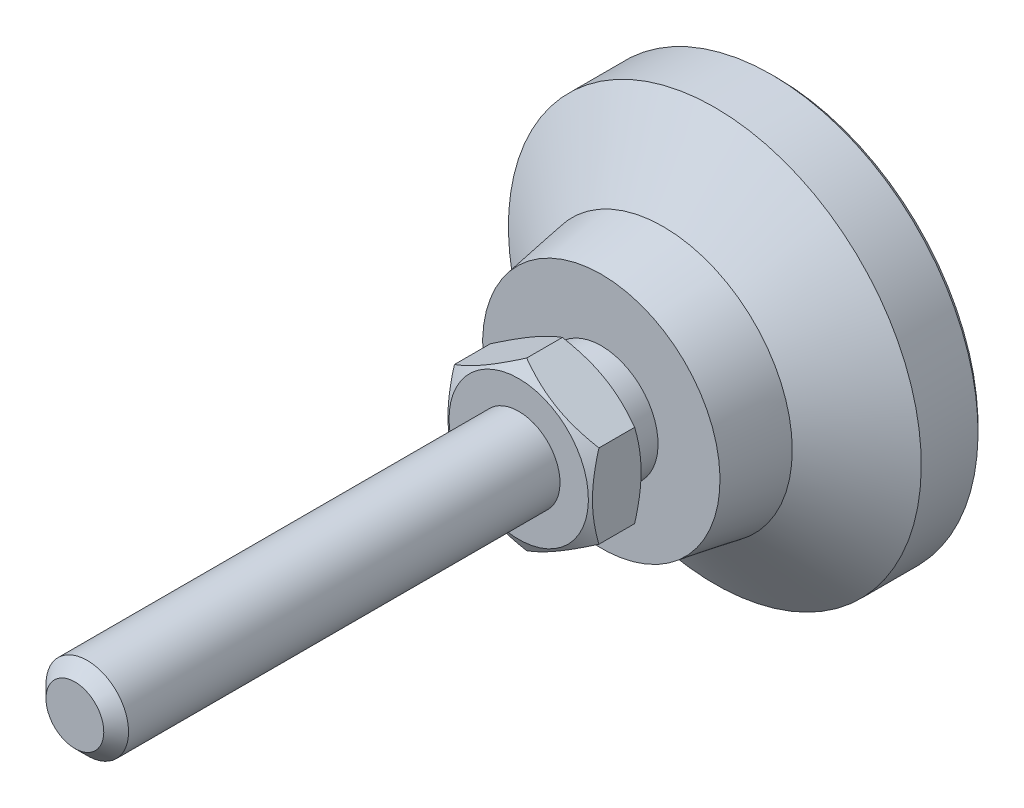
ISO-10303-21;
HEADER;
FILE_DESCRIPTION(('STEP AP214'),'2;1');
FILE_NAME('part.step','',(''),(''),'','','');
FILE_SCHEMA(('AUTOMOTIVE_DESIGN { 1 0 10303 214 1 1 1 1 }'));
ENDSEC;
DATA;
#1=APPLICATION_CONTEXT('core data for automotive mechanical design processes');
#2=APPLICATION_PROTOCOL_DEFINITION('international standard','automotive_design',2000,#1);
#3=PRODUCT_CONTEXT('',#1,'mechanical');
#4=PRODUCT('Part','Part','',(#3));
#5=PRODUCT_RELATED_PRODUCT_CATEGORY('part','',(#4));
#6=PRODUCT_DEFINITION_FORMATION('','',#4);
#7=PRODUCT_DEFINITION_CONTEXT('part definition',#1,'design');
#8=PRODUCT_DEFINITION('design','',#6,#7);
#9=PRODUCT_DEFINITION_SHAPE('','',#8);
#10=(LENGTH_UNIT() NAMED_UNIT(*) SI_UNIT(.MILLI.,.METRE.));
#11=(NAMED_UNIT(*) PLANE_ANGLE_UNIT() SI_UNIT($,.RADIAN.));
#12=(NAMED_UNIT(*) SI_UNIT($,.STERADIAN.) SOLID_ANGLE_UNIT());
#13=UNCERTAINTY_MEASURE_WITH_UNIT(LENGTH_MEASURE(1.E-05),#10,'distance_accuracy_value','');
#14=(GEOMETRIC_REPRESENTATION_CONTEXT(3) GLOBAL_UNCERTAINTY_ASSIGNED_CONTEXT((#13)) GLOBAL_UNIT_ASSIGNED_CONTEXT((#10,
#11,#12)) REPRESENTATION_CONTEXT('',''));
#15=CARTESIAN_POINT('',(0.,0.,0.));
#16=DIRECTION('',(0.,0.,1.));
#17=DIRECTION('',(1.,0.,0.));
#18=AXIS2_PLACEMENT_3D('',#15,#16,#17);
#19=CARTESIAN_POINT('',(-5.49999999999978,0.,20.));
#20=DIRECTION('',(0.,0.,1.));
#21=DIRECTION('',(0.,-1.,0.));
#22=AXIS2_PLACEMENT_3D('',#19,#20,#21);
#23=PLANE('',#22);
#24=CARTESIAN_POINT('',(0.,0.,20.));
#25=DIRECTION('',(0.,0.,-1.));
#26=DIRECTION('',(0.,1.,0.));
#27=AXIS2_PLACEMENT_3D('',#24,#25,#26);
#28=CIRCLE('',#27,5.49999999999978);
#29=CARTESIAN_POINT('',(0.,5.49999999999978,20.));
#30=VERTEX_POINT('',#29);
#31=EDGE_CURVE('E103',#30,#30,#28,.T.);
#32=ORIENTED_EDGE('',*,*,#31,.F.);
#33=EDGE_LOOP('',(#32));
#34=FACE_BOUND('',#33,.T.);
#35=CARTESIAN_POINT('',(0.,0.,20.));
#36=DIRECTION('',(0.,0.,-1.));
#37=DIRECTION('',(0.,1.,0.));
#38=AXIS2_PLACEMENT_3D('',#35,#36,#37);
#39=CIRCLE('',#38,6.75);
#40=CARTESIAN_POINT('',(0.,6.75,20.));
#41=VERTEX_POINT('',#40);
#42=EDGE_CURVE('E73',#41,#41,#39,.T.);
#43=ORIENTED_EDGE('',*,*,#42,.T.);
#44=EDGE_LOOP('',(#43));
#45=FACE_BOUND('',#44,.T.);
#46=ADVANCED_FACE('F14',(#34,#45),#23,.F.);
#47=CARTESIAN_POINT('',(0.,0.,-1.00000000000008));
#48=DIRECTION('',(0.,0.,-1.));
#49=DIRECTION('',(0.,1.,0.));
#50=AXIS2_PLACEMENT_3D('',#47,#48,#49);
#51=CYLINDRICAL_SURFACE('',#50,20.);
#52=CARTESIAN_POINT('',(0.,0.,0.500000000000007));
#53=DIRECTION('',(0.,0.,-1.));
#54=DIRECTION('',(0.,1.,0.));
#55=AXIS2_PLACEMENT_3D('',#52,#53,#54);
#56=CIRCLE('',#55,20.);
#57=CARTESIAN_POINT('',(0.,20.,0.500000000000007));
#58=VERTEX_POINT('',#57);
#59=EDGE_CURVE('E9',#58,#58,#56,.F.);
#60=ORIENTED_EDGE('',*,*,#59,.T.);
#61=EDGE_LOOP('',(#60));
#62=FACE_BOUND('',#61,.T.);
#63=CARTESIAN_POINT('',(0.,0.,6.));
#64=DIRECTION('',(0.,0.,-1.));
#65=DIRECTION('',(0.,1.,0.));
#66=AXIS2_PLACEMENT_3D('',#63,#64,#65);
#67=CIRCLE('',#66,20.);
#68=CARTESIAN_POINT('',(0.,20.,6.));
#69=VERTEX_POINT('',#68);
#70=EDGE_CURVE('E115',#69,#69,#67,.T.);
#71=ORIENTED_EDGE('',*,*,#70,.T.);
#72=EDGE_LOOP('',(#71));
#73=FACE_BOUND('',#72,.T.);
#74=ADVANCED_FACE('F136',(#62,#73),#51,.T.);
#75=CARTESIAN_POINT('',(0.,0.,11.));
#76=DIRECTION('',(0.,0.,-1.));
#77=DIRECTION('',(0.,1.,0.));
#78=AXIS2_PLACEMENT_3D('',#75,#76,#77);
#79=CONICAL_SURFACE('',#78,12.5,0.98279372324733);
#80=ORIENTED_EDGE('',*,*,#70,.F.);
#81=EDGE_LOOP('',(#80));
#82=FACE_BOUND('',#81,.T.);
#83=CARTESIAN_POINT('',(0.,0.,11.));
#84=DIRECTION('',(0.,0.,-1.));
#85=DIRECTION('',(0.,1.,0.));
#86=AXIS2_PLACEMENT_3D('',#83,#84,#85);
#87=CIRCLE('',#86,12.5);
#88=CARTESIAN_POINT('',(0.,12.5,11.));
#89=VERTEX_POINT('',#88);
#90=EDGE_CURVE('E112',#89,#89,#87,.T.);
#91=ORIENTED_EDGE('',*,*,#90,.T.);
#92=EDGE_LOOP('',(#91));
#93=FACE_BOUND('',#92,.T.);
#94=ADVANCED_FACE('F143',(#82,#93),#79,.T.);
#95=CARTESIAN_POINT('',(0.,0.,17.));
#96=DIRECTION('',(0.,0.,-1.));
#97=DIRECTION('',(0.,1.,0.));
#98=AXIS2_PLACEMENT_3D('',#95,#96,#97);
#99=CONICAL_SURFACE('',#98,11.5,0.165148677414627);
#100=ORIENTED_EDGE('',*,*,#90,.F.);
#101=EDGE_LOOP('',(#100));
#102=FACE_BOUND('',#101,.T.);
#103=CARTESIAN_POINT('',(0.,0.,17.));
#104=DIRECTION('',(0.,0.,-1.));
#105=DIRECTION('',(0.,1.,0.));
#106=AXIS2_PLACEMENT_3D('',#103,#104,#105);
#107=CIRCLE('',#106,11.5);
#108=CARTESIAN_POINT('',(0.,11.5,17.));
#109=VERTEX_POINT('',#108);
#110=EDGE_CURVE('E109',#109,#109,#107,.T.);
#111=ORIENTED_EDGE('',*,*,#110,.T.);
#112=EDGE_LOOP('',(#111));
#113=FACE_BOUND('',#112,.T.);
#114=ADVANCED_FACE('F157',(#102,#113),#99,.T.);
#115=CARTESIAN_POINT('',(-11.5,0.,17.));
#116=DIRECTION('',(0.,0.,-1.));
#117=DIRECTION('',(0.,1.,0.));
#118=AXIS2_PLACEMENT_3D('',#115,#116,#117);
#119=PLANE('',#118);
#120=ORIENTED_EDGE('',*,*,#110,.F.);
#121=EDGE_LOOP('',(#120));
#122=FACE_BOUND('',#121,.T.);
#123=CARTESIAN_POINT('',(0.,0.,17.));
#124=DIRECTION('',(0.,0.,-1.));
#125=DIRECTION('',(0.,1.,0.));
#126=AXIS2_PLACEMENT_3D('',#123,#124,#125);
#127=CIRCLE('',#126,5.49999999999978);
#128=CARTESIAN_POINT('',(0.,5.49999999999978,17.));
#129=VERTEX_POINT('',#128);
#130=EDGE_CURVE('E106',#129,#129,#127,.T.);
#131=ORIENTED_EDGE('',*,*,#130,.T.);
#132=EDGE_LOOP('',(#131));
#133=FACE_BOUND('',#132,.T.);
#134=ADVANCED_FACE('F153',(#122,#133),#119,.F.);
#135=CARTESIAN_POINT('',(0.,0.,-1.00000000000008));
#136=DIRECTION('',(0.,0.,-1.));
#137=DIRECTION('',(0.,1.,0.));
#138=AXIS2_PLACEMENT_3D('',#135,#136,#137);
#139=CYLINDRICAL_SURFACE('',#138,5.49999999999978);
#140=ORIENTED_EDGE('',*,*,#130,.F.);
#141=EDGE_LOOP('',(#140));
#142=FACE_BOUND('',#141,.T.);
#143=ORIENTED_EDGE('',*,*,#31,.T.);
#144=EDGE_LOOP('',(#143));
#145=FACE_BOUND('',#144,.T.);
#146=ADVANCED_FACE('F132',(#142,#145),#139,.T.);
#147=CARTESIAN_POINT('',(0.,0.,0.));
#148=DIRECTION('',(0.,0.,-1.));
#149=DIRECTION('',(0.,1.,0.));
#150=AXIS2_PLACEMENT_3D('',#147,#148,#149);
#151=PLANE('',#150);
#152=CARTESIAN_POINT('',(0.,0.,0.));
#153=DIRECTION('',(0.,0.,-1.));
#154=DIRECTION('',(0.,1.,0.));
#155=AXIS2_PLACEMENT_3D('',#152,#153,#154);
#156=CIRCLE('',#155,19.5);
#157=CARTESIAN_POINT('',(0.,19.5,0.));
#158=VERTEX_POINT('',#157);
#159=EDGE_CURVE('E22',#158,#158,#156,.T.);
#160=ORIENTED_EDGE('',*,*,#159,.T.);
#161=EDGE_LOOP('',(#160));
#162=FACE_BOUND('',#161,.T.);
#163=ADVANCED_FACE('F120',(#162),#151,.T.);
#164=CARTESIAN_POINT('',(0.,0.,0.));
#165=DIRECTION('',(0.,0.,1.));
#166=DIRECTION('',(0.,-1.,0.));
#167=AXIS2_PLACEMENT_3D('',#164,#165,#166);
#168=CONICAL_SURFACE('',#167,19.5,0.785398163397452);
#169=ORIENTED_EDGE('',*,*,#59,.F.);
#170=EDGE_LOOP('',(#169));
#171=FACE_BOUND('',#170,.T.);
#172=ORIENTED_EDGE('',*,*,#159,.F.);
#173=EDGE_LOOP('',(#172));
#174=FACE_BOUND('',#173,.T.);
#175=ADVANCED_FACE('F16',(#171,#174),#168,.T.);
#176=CARTESIAN_POINT('',(0.,0.,20.));
#177=DIRECTION('',(0.,0.,1.));
#178=DIRECTION('',(0.,-1.,0.));
#179=AXIS2_PLACEMENT_3D('',#176,#177,#178);
#180=CONICAL_SURFACE('',#179,6.75,1.0471975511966);
#181=CARTESIAN_POINT('',(-7.,10.8211396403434,23.5436979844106));
#182=CARTESIAN_POINT('',(-7.,10.515691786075,23.3956682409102));
#183=CARTESIAN_POINT('',(-7.,10.2095390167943,23.2490679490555));
#184=CARTESIAN_POINT('',(-7.,9.59544862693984,22.9595309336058));
#185=CARTESIAN_POINT('',(-7.,9.28751073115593,22.8165947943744));
#186=CARTESIAN_POINT('',(-7.,8.66787178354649,22.5344642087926));
#187=CARTESIAN_POINT('',(-7.,8.35615934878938,22.3952946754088));
#188=CARTESIAN_POINT('',(-7.,7.73024308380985,22.1226974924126));
#189=CARTESIAN_POINT('',(-7.,7.41603937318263,21.9892695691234));
#190=CARTESIAN_POINT('',(-7.,6.77463559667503,21.7255591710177));
#191=CARTESIAN_POINT('',(-7.,6.44733904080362,21.595510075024));
#192=CARTESIAN_POINT('',(-7.,5.78890478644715,21.3453387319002));
#193=CARTESIAN_POINT('',(-7.,5.45776665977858,21.2252176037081));
#194=CARTESIAN_POINT('',(-7.,4.79174951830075,20.9980814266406));
#195=CARTESIAN_POINT('',(-7.,4.45687975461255,20.8910395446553));
#196=CARTESIAN_POINT('',(-7.,3.7823491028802,20.693518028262));
#197=CARTESIAN_POINT('',(-7.,3.44268977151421,20.6030331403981));
#198=CARTESIAN_POINT('',(-7.,2.76020781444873,20.443475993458));
#199=CARTESIAN_POINT('',(-7.,2.41741275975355,20.3742890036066));
#200=CARTESIAN_POINT('',(-7.,1.90012652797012,20.2894948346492));
#201=CARTESIAN_POINT('',(-7.,1.72716921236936,20.2643933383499));
#202=CARTESIAN_POINT('',(-7.,1.38040674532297,20.2210122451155));
#203=CARTESIAN_POINT('',(-7.,1.20660167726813,20.2027319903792));
#204=CARTESIAN_POINT('',(-7.,0.860631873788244,20.1735850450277));
#205=CARTESIAN_POINT('',(-7.,0.68847498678,20.1626255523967));
#206=CARTESIAN_POINT('',(-7.,0.34385219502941,20.1479941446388));
#207=CARTESIAN_POINT('',(-7.,0.171386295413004,20.1443221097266));
#208=CARTESIAN_POINT('',(-7.,-0.173546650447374,20.1443531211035));
#209=CARTESIAN_POINT('',(-7.,-0.346013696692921,20.1480562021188));
#210=CARTESIAN_POINT('',(-7.,-0.690639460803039,20.1627475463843));
#211=CARTESIAN_POINT('',(-7.,-0.862798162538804,20.173736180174));
#212=CARTESIAN_POINT('',(-7.,-1.27760458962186,20.2087585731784));
#213=CARTESIAN_POINT('',(-7.,-1.51996165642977,20.2363077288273));
#214=CARTESIAN_POINT('',(-7.,-2.00284274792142,20.3043331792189));
#215=CARTESIAN_POINT('',(-7.,-2.24336651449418,20.3448112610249));
#216=CARTESIAN_POINT('',(-7.,-2.96193206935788,20.4834895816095));
#217=CARTESIAN_POINT('',(-7.,-3.43669298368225,20.598907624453));
#218=CARTESIAN_POINT('',(-7.,-4.14654319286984,20.7986227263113));
#219=CARTESIAN_POINT('',(-7.,-4.38532521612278,20.8705458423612));
#220=CARTESIAN_POINT('',(-7.,-4.86056929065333,21.021755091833));
#221=CARTESIAN_POINT('',(-7.,-5.09703132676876,21.1010412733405));
#222=CARTESIAN_POINT('',(-7.,-5.56771190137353,21.265713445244));
#223=CARTESIAN_POINT('',(-7.,-5.80193117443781,21.3510973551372));
#224=CARTESIAN_POINT('',(-7.,-6.26843635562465,21.5269710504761));
#225=CARTESIAN_POINT('',(-7.,-6.50072228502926,21.6174607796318));
#226=CARTESIAN_POINT('',(-7.,-7.04333551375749,21.8346160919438));
#227=CARTESIAN_POINT('',(-7.,-7.35297279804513,21.9630025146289));
#228=CARTESIAN_POINT('',(-7.,-7.96966297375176,22.2258564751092));
#229=CARTESIAN_POINT('',(-7.,-8.27671571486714,22.3603243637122));
#230=CARTESIAN_POINT('',(-7.,-8.88870489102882,22.634135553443));
#231=CARTESIAN_POINT('',(-7.,-9.19364090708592,22.7734797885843));
#232=CARTESIAN_POINT('',(-7.,-9.80169780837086,23.0560807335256));
#233=CARTESIAN_POINT('',(-7.,-10.1048186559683,23.1993375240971));
#234=CARTESIAN_POINT('',(-7.,-10.7098446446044,23.4891845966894));
#235=CARTESIAN_POINT('',(-7.,-11.0117482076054,23.635778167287));
#236=CARTESIAN_POINT('',(-7.,-11.6142651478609,23.9315955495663));
#237=CARTESIAN_POINT('',(-7.,-11.9148785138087,24.0808193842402));
#238=CARTESIAN_POINT('',(-7.,-12.8150115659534,24.5317065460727));
#239=CARTESIAN_POINT('',(-7.,-13.412901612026,24.8366229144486));
#240=CARTESIAN_POINT('',(-7.,-14.5564152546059,25.427222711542));
#241=CARTESIAN_POINT('',(-7.,-15.1022895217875,25.7124229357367));
#242=CARTESIAN_POINT('',(-7.,-16.1920054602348,26.2867218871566));
#243=CARTESIAN_POINT('',(-7.,-16.7358470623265,26.5758207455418));
#244=CARTESIAN_POINT('',(-7.,-17.8206289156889,27.1562913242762));
#245=CARTESIAN_POINT('',(-7.,-18.3615730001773,27.447655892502));
#246=CARTESIAN_POINT('',(-7.,-19.4421583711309,28.0327232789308));
#247=CARTESIAN_POINT('',(-7.,-19.9817997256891,28.3264259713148));
#248=CARTESIAN_POINT('',(-7.,-20.5209600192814,28.6210032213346));
#249=B_SPLINE_CURVE_WITH_KNOTS('',3,(#181,#182,#183,#184,#185,#186,#187,#188,#189,#190,#191,
#192,#193,#194,#195,#196,#197,#198,#199,#200,#201,#202,#203,#204,#205,#206,#207,#208,#209,#210,
#211,#212,#213,#214,#215,#216,#217,#218,#219,#220,#221,#222,#223,#224,#225,#226,#227,#228,#229,
#230,#231,#232,#233,#234,#235,#236,#237,#238,#239,#240,#241,#242,#243,#244,#245,#246,#247,#248),
.UNSPECIFIED.,.F.,.F.,(4,2,2,2,2,2,2,2,2,2,2,2,2,2,2,2,2,2,2,2,2,2,2,2,2,2,2,2,2,2,2,2,2,4),(0.,
1.01829584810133,2.03675309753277,3.06081374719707,4.08482553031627,5.14126209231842,
6.19781755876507,7.25216766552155,8.30618264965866,9.35441611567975,9.8786107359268,
10.4027547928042,10.9201216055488,11.4374799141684,11.9548406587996,12.4722277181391,
13.2035671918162,13.9350077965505,15.3987144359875,16.1467898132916,16.8948700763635,
17.6426963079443,18.3905142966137,19.396024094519,20.4015919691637,21.4073535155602,
22.4131358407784,23.4199564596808,24.4267858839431,26.4401868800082,28.2878337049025,
30.1355428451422,31.9788013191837,33.8219612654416),.UNSPECIFIED.);
#250=CARTESIAN_POINT('',(-7.,4.04145188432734,20.7695523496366));
#251=VERTEX_POINT('',#250);
#252=CARTESIAN_POINT('',(-7.,-4.04145188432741,20.7695523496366));
#253=VERTEX_POINT('',#252);
#254=EDGE_CURVE('E79',#251,#253,#249,.T.);
#255=ORIENTED_EDGE('',*,*,#254,.F.);
#256=CARTESIAN_POINT('',(0.000200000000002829,8.08301923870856,20.7696190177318));
#257=CARTESIAN_POINT('',(-0.153667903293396,7.99418356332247,20.7183374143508));
#258=CARTESIAN_POINT('',(-0.308109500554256,7.90501666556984,20.669383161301));
#259=CARTESIAN_POINT('',(-0.618246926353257,7.725958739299,20.5767703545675));
#260=CARTESIAN_POINT('',(-0.773943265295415,7.63606741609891,20.5331140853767));
#261=CARTESIAN_POINT('',(-1.24352516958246,7.36495417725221,20.4109491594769));
#262=CARTESIAN_POINT('',(-1.5592643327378,7.18266208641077,20.3414631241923));
#263=CARTESIAN_POINT('',(-2.03176224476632,6.90986528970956,20.2599825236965));
#264=CARTESIAN_POINT('',(-2.18710922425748,6.82017566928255,20.2367710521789));
#265=CARTESIAN_POINT('',(-2.49850511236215,6.64039116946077,20.1978487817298));
#266=CARTESIAN_POINT('',(-2.6545539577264,6.550296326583,20.1821373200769));
#267=CARTESIAN_POINT('',(-2.96692267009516,6.36995016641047,20.1586154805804));
#268=CARTESIAN_POINT('',(-3.12324202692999,6.27969914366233,20.1507961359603));
#269=CARTESIAN_POINT('',(-3.43601650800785,6.09911871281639,20.1432178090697));
#270=CARTESIAN_POINT('',(-3.59247162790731,6.00878930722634,20.1434585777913));
#271=CARTESIAN_POINT('',(-4.02110687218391,5.76131663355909,20.1551972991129));
#272=CARTESIAN_POINT('',(-4.29314668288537,5.6042543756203,20.1749033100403));
#273=CARTESIAN_POINT('',(-4.83541944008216,5.29117305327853,20.2373910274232));
#274=CARTESIAN_POINT('',(-5.10565047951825,5.13515508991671,20.2801940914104));
#275=CARTESIAN_POINT('',(-5.64901454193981,4.82144370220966,20.3871892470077));
#276=CARTESIAN_POINT('',(-5.92207900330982,4.66378986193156,20.4518346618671));
#277=CARTESIAN_POINT('',(-6.46413578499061,4.35083323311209,20.5985536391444));
#278=CARTESIAN_POINT('',(-6.73313504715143,4.19552643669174,20.6805927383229));
#279=CARTESIAN_POINT('',(-7.0002,4.0413364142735,20.7696190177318));
#280=B_SPLINE_CURVE_WITH_KNOTS('',3,(#256,#257,#258,#259,#260,#261,#262,#263,#264,#265,#266,
#267,#268,#269,#270,#271,#272,#273,#274,#275,#276,#277,#278,#279),.UNSPECIFIED.,.F.,.F.,(4,2,2,
2,2,2,2,2,2,2,2,4),(0.,0.554727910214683,1.10969417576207,2.22193274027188,2.76443041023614,
3.30688013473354,3.84871284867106,4.39052882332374,5.33376515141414,6.27787517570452,
7.24292418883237,8.20607866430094),.UNSPECIFIED.);
#281=CARTESIAN_POINT('',(0.,8.08290376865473,20.7695523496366));
#282=VERTEX_POINT('',#281);
#283=EDGE_CURVE('E374',#282,#251,#280,.T.);
#284=ORIENTED_EDGE('',*,*,#283,.F.);
#285=CARTESIAN_POINT('',(7.0002,4.04133641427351,20.7696190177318));
#286=CARTESIAN_POINT('',(6.8463320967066,4.1301720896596,20.7183374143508));
#287=CARTESIAN_POINT('',(6.69189049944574,4.21933898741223,20.669383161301));
#288=CARTESIAN_POINT('',(6.38175307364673,4.39839691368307,20.5767703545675));
#289=CARTESIAN_POINT('',(6.22605673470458,4.48828823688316,20.5331140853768));
#290=CARTESIAN_POINT('',(5.75647483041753,4.75940147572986,20.4109491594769));
#291=CARTESIAN_POINT('',(5.44073566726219,4.9416935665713,20.3414631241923));
#292=CARTESIAN_POINT('',(4.96823775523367,5.21449036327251,20.2599825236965));
#293=CARTESIAN_POINT('',(4.81289077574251,5.30417998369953,20.2367710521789));
#294=CARTESIAN_POINT('',(4.50149488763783,5.4839644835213,20.1978487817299));
#295=CARTESIAN_POINT('',(4.34544604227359,5.57405932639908,20.1821373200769));
#296=CARTESIAN_POINT('',(4.03307732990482,5.7544054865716,20.1586154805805));
#297=CARTESIAN_POINT('',(3.87675797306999,5.84465650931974,20.1507961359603));
#298=CARTESIAN_POINT('',(3.56398349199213,6.02523694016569,20.1432178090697));
#299=CARTESIAN_POINT('',(3.40752837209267,6.11556634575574,20.1434585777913));
#300=CARTESIAN_POINT('',(2.97889312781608,6.36303901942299,20.1551972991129));
#301=CARTESIAN_POINT('',(2.70685331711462,6.52010127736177,20.1749033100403));
#302=CARTESIAN_POINT('',(2.16458055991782,6.83318259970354,20.2373910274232));
#303=CARTESIAN_POINT('',(1.89434952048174,6.98920056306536,20.2801940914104));
#304=CARTESIAN_POINT('',(1.35098545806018,7.30291195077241,20.3871892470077));
#305=CARTESIAN_POINT('',(1.07792099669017,7.46056579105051,20.4518346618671));
#306=CARTESIAN_POINT('',(0.535864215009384,7.77352241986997,20.5985536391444));
#307=CARTESIAN_POINT('',(0.266864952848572,7.92882921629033,20.6805927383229));
#308=CARTESIAN_POINT('',(-0.000199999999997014,8.08301923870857,20.7696190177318));
#309=B_SPLINE_CURVE_WITH_KNOTS('',3,(#285,#286,#287,#288,#289,#290,#291,#292,#293,#294,#295,
#296,#297,#298,#299,#300,#301,#302,#303,#304,#305,#306,#307,#308),.UNSPECIFIED.,.F.,.F.,(4,2,2,
2,2,2,2,2,2,2,2,4),(0.,0.554727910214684,1.10969417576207,2.22193274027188,2.76443041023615,
3.30688013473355,3.84871284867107,4.39052882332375,5.33376515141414,6.27787517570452,
7.24292418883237,8.20607866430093),.UNSPECIFIED.);
#310=CARTESIAN_POINT('',(7.,4.04145188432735,20.7695523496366));
#311=VERTEX_POINT('',#310);
#312=EDGE_CURVE('E369',#311,#282,#309,.T.);
#313=ORIENTED_EDGE('',*,*,#312,.F.);
#314=CARTESIAN_POINT('',(7.,10.8211396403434,23.5436979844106));
#315=CARTESIAN_POINT('',(7.,10.515691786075,23.3956682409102));
#316=CARTESIAN_POINT('',(7.,10.2095390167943,23.2490679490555));
#317=CARTESIAN_POINT('',(7.,9.59544862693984,22.9595309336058));
#318=CARTESIAN_POINT('',(7.,9.28751073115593,22.8165947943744));
#319=CARTESIAN_POINT('',(7.,8.66787178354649,22.5344642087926));
#320=CARTESIAN_POINT('',(7.,8.35615934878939,22.3952946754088));
#321=CARTESIAN_POINT('',(7.,7.73024308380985,22.1226974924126));
#322=CARTESIAN_POINT('',(7.,7.41603937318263,21.9892695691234));
#323=CARTESIAN_POINT('',(7.,6.77463559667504,21.7255591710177));
#324=CARTESIAN_POINT('',(7.,6.44733904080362,21.595510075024));
#325=CARTESIAN_POINT('',(7.,5.78890478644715,21.3453387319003));
#326=CARTESIAN_POINT('',(7.,5.45776665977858,21.2252176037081));
#327=CARTESIAN_POINT('',(7.,4.79174951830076,20.9980814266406));
#328=CARTESIAN_POINT('',(7.,4.45687975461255,20.8910395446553));
#329=CARTESIAN_POINT('',(7.,3.78234910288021,20.693518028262));
#330=CARTESIAN_POINT('',(7.,3.44268977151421,20.6030331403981));
#331=CARTESIAN_POINT('',(7.,2.76020781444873,20.443475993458));
#332=CARTESIAN_POINT('',(7.,2.41741275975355,20.3742890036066));
#333=CARTESIAN_POINT('',(7.,1.90012652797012,20.2894948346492));
#334=CARTESIAN_POINT('',(7.,1.72716921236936,20.2643933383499));
#335=CARTESIAN_POINT('',(7.,1.38040674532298,20.2210122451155));
#336=CARTESIAN_POINT('',(7.,1.20660167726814,20.2027319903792));
#337=CARTESIAN_POINT('',(7.,0.86063187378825,20.1735850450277));
#338=CARTESIAN_POINT('',(7.,0.688474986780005,20.1626255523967));
#339=CARTESIAN_POINT('',(7.,0.343852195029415,20.1479941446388));
#340=CARTESIAN_POINT('',(7.,0.171386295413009,20.1443221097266));
#341=CARTESIAN_POINT('',(7.,-0.17354665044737,20.1443531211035));
#342=CARTESIAN_POINT('',(7.,-0.346013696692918,20.1480562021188));
#343=CARTESIAN_POINT('',(7.,-0.690639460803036,20.1627475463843));
#344=CARTESIAN_POINT('',(7.,-0.8627981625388,20.173736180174));
#345=CARTESIAN_POINT('',(7.,-1.27760458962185,20.2087585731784));
#346=CARTESIAN_POINT('',(7.,-1.51996165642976,20.2363077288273));
#347=CARTESIAN_POINT('',(7.,-2.00284274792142,20.3043331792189));
#348=CARTESIAN_POINT('',(7.,-2.24336651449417,20.3448112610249));
#349=CARTESIAN_POINT('',(7.,-2.96193206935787,20.4834895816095));
#350=CARTESIAN_POINT('',(7.,-3.43669298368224,20.598907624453));
#351=CARTESIAN_POINT('',(7.,-4.14654319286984,20.7986227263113));
#352=CARTESIAN_POINT('',(7.,-4.38532521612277,20.8705458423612));
#353=CARTESIAN_POINT('',(7.,-4.86056929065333,21.021755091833));
#354=CARTESIAN_POINT('',(7.,-5.09703132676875,21.1010412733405));
#355=CARTESIAN_POINT('',(7.,-5.56771190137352,21.265713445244));
#356=CARTESIAN_POINT('',(7.,-5.8019311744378,21.3510973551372));
#357=CARTESIAN_POINT('',(7.,-6.26843635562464,21.5269710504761));
#358=CARTESIAN_POINT('',(7.,-6.50072228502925,21.6174607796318));
#359=CARTESIAN_POINT('',(7.,-7.04333551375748,21.8346160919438));
#360=CARTESIAN_POINT('',(7.,-7.35297279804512,21.9630025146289));
#361=CARTESIAN_POINT('',(7.,-7.96966297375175,22.2258564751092));
#362=CARTESIAN_POINT('',(7.,-8.27671571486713,22.3603243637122));
#363=CARTESIAN_POINT('',(7.,-8.88870489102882,22.634135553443));
#364=CARTESIAN_POINT('',(7.,-9.19364090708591,22.7734797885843));
#365=CARTESIAN_POINT('',(7.,-9.80169780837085,23.0560807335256));
#366=CARTESIAN_POINT('',(7.,-10.1048186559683,23.1993375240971));
#367=CARTESIAN_POINT('',(7.,-10.7098446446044,23.4891845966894));
#368=CARTESIAN_POINT('',(7.,-11.0117482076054,23.635778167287));
#369=CARTESIAN_POINT('',(7.,-11.6142651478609,23.9315955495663));
#370=CARTESIAN_POINT('',(7.,-11.9148785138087,24.0808193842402));
#371=CARTESIAN_POINT('',(7.,-12.8150115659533,24.5317065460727));
#372=CARTESIAN_POINT('',(7.,-13.4129016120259,24.8366229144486));
#373=CARTESIAN_POINT('',(7.,-14.5564152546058,25.427222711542));
#374=CARTESIAN_POINT('',(7.,-15.1022895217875,25.7124229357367));
#375=CARTESIAN_POINT('',(7.,-16.1920054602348,26.2867218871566));
#376=CARTESIAN_POINT('',(7.,-16.7358470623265,26.5758207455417));
#377=CARTESIAN_POINT('',(7.,-17.8206289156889,27.1562913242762));
#378=CARTESIAN_POINT('',(7.,-18.3615730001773,27.447655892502));
#379=CARTESIAN_POINT('',(7.,-19.4421583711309,28.0327232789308));
#380=CARTESIAN_POINT('',(7.,-19.9817997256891,28.3264259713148));
#381=CARTESIAN_POINT('',(7.,-20.5209600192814,28.6210032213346));
#382=B_SPLINE_CURVE_WITH_KNOTS('',3,(#314,#315,#316,#317,#318,#319,#320,#321,#322,#323,#324,
#325,#326,#327,#328,#329,#330,#331,#332,#333,#334,#335,#336,#337,#338,#339,#340,#341,#342,#343,
#344,#345,#346,#347,#348,#349,#350,#351,#352,#353,#354,#355,#356,#357,#358,#359,#360,#361,#362,
#363,#364,#365,#366,#367,#368,#369,#370,#371,#372,#373,#374,#375,#376,#377,#378,#379,#380,#381),
.UNSPECIFIED.,.F.,.F.,(4,2,2,2,2,2,2,2,2,2,2,2,2,2,2,2,2,2,2,2,2,2,2,2,2,2,2,2,2,2,2,2,2,4),(0.,
1.01829584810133,2.03675309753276,3.06081374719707,4.08482553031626,5.14126209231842,
6.19781755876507,7.25216766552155,8.30618264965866,9.35441611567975,9.87861073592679,
10.4027547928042,10.9201216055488,11.4374799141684,11.9548406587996,12.4722277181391,
13.2035671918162,13.9350077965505,15.3987144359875,16.1467898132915,16.8948700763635,
17.6426963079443,18.3905142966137,19.396024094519,20.4015919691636,21.4073535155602,
22.4131358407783,23.4199564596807,24.4267858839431,26.4401868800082,28.2878337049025,
30.1355428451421,31.9788013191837,33.8219612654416),.UNSPECIFIED.);
#383=CARTESIAN_POINT('',(7.,-4.04145188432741,20.7695523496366));
#384=VERTEX_POINT('',#383);
#385=EDGE_CURVE('E29',#384,#311,#382,.F.);
#386=ORIENTED_EDGE('',*,*,#385,.F.);
#387=CARTESIAN_POINT('',(-0.000199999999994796,-8.08301923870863,20.7696190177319));
#388=CARTESIAN_POINT('',(0.153667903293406,-7.99418356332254,20.7183374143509));
#389=CARTESIAN_POINT('',(0.308109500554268,-7.90501666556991,20.669383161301));
#390=CARTESIAN_POINT('',(0.618246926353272,-7.72595873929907,20.5767703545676));
#391=CARTESIAN_POINT('',(0.773943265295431,-7.63606741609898,20.5331140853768));
#392=CARTESIAN_POINT('',(1.24352516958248,-7.36495417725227,20.4109491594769));
#393=CARTESIAN_POINT('',(1.55926433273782,-7.18266208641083,20.3414631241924));
#394=CARTESIAN_POINT('',(2.03176224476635,-6.90986528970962,20.2599825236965));
#395=CARTESIAN_POINT('',(2.18710922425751,-6.82017566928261,20.2367710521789));
#396=CARTESIAN_POINT('',(2.49850511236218,-6.64039116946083,20.1978487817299));
#397=CARTESIAN_POINT('',(2.65455395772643,-6.55029632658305,20.1821373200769));
#398=CARTESIAN_POINT('',(2.9669226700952,-6.36995016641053,20.1586154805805));
#399=CARTESIAN_POINT('',(3.12324202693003,-6.27969914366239,20.1507961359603));
#400=CARTESIAN_POINT('',(3.43601650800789,-6.09911871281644,20.1432178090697));
#401=CARTESIAN_POINT('',(3.59247162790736,-6.00878930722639,20.1434585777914));
#402=CARTESIAN_POINT('',(4.02110687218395,-5.76131663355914,20.1551972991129));
#403=CARTESIAN_POINT('',(4.29314668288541,-5.60425437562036,20.1749033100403));
#404=CARTESIAN_POINT('',(4.8354194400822,-5.29117305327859,20.2373910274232));
#405=CARTESIAN_POINT('',(5.10565047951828,-5.13515508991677,20.2801940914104));
#406=CARTESIAN_POINT('',(5.64901454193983,-4.82144370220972,20.3871892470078));
#407=CARTESIAN_POINT('',(5.92207900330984,-4.66378986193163,20.4518346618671));
#408=CARTESIAN_POINT('',(6.46413578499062,-4.35083323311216,20.5985536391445));
#409=CARTESIAN_POINT('',(6.73313504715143,-4.19552643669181,20.680592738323));
#410=CARTESIAN_POINT('',(7.0002,-4.04133641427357,20.7696190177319));
#411=B_SPLINE_CURVE_WITH_KNOTS('',3,(#387,#388,#389,#390,#391,#392,#393,#394,#395,#396,#397,
#398,#399,#400,#401,#402,#403,#404,#405,#406,#407,#408,#409,#410),.UNSPECIFIED.,.F.,.F.,(4,2,2,
2,2,2,2,2,2,2,2,4),(0.,0.554727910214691,1.10969417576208,2.2219327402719,2.76443041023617,
3.30688013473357,3.8487128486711,4.39052882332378,5.33376515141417,6.27787517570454,
7.24292418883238,8.20607866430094),.UNSPECIFIED.);
#412=CARTESIAN_POINT('',(0.,-8.08290376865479,20.7695523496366));
#413=VERTEX_POINT('',#412);
#414=EDGE_CURVE('E66',#413,#384,#411,.T.);
#415=ORIENTED_EDGE('',*,*,#414,.F.);
#416=CARTESIAN_POINT('',(-7.0002,-4.04133641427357,20.7696190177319));
#417=CARTESIAN_POINT('',(-6.8463320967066,-4.13017208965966,20.7183374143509));
#418=CARTESIAN_POINT('',(-6.69189049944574,-4.21933898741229,20.669383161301));
#419=CARTESIAN_POINT('',(-6.38175307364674,-4.39839691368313,20.5767703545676));
#420=CARTESIAN_POINT('',(-6.22605673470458,-4.48828823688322,20.5331140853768));
#421=CARTESIAN_POINT('',(-5.75647483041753,-4.75940147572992,20.4109491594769));
#422=CARTESIAN_POINT('',(-5.44073566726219,-4.94169356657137,20.3414631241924));
#423=CARTESIAN_POINT('',(-4.96823775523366,-5.21449036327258,20.2599825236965));
#424=CARTESIAN_POINT('',(-4.8128907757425,-5.30417998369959,20.2367710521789));
#425=CARTESIAN_POINT('',(-4.50149488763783,-5.48396448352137,20.1978487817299));
#426=CARTESIAN_POINT('',(-4.34544604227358,-5.57405932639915,20.1821373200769));
#427=CARTESIAN_POINT('',(-4.03307732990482,-5.75440548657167,20.1586154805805));
#428=CARTESIAN_POINT('',(-3.87675797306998,-5.84465650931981,20.1507961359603));
#429=CARTESIAN_POINT('',(-3.56398349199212,-6.02523694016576,20.1432178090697));
#430=CARTESIAN_POINT('',(-3.40752837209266,-6.11556634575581,20.1434585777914));
#431=CARTESIAN_POINT('',(-2.97889312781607,-6.36303901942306,20.1551972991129));
#432=CARTESIAN_POINT('',(-2.7068533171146,-6.52010127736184,20.1749033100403));
#433=CARTESIAN_POINT('',(-2.16458055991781,-6.83318259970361,20.2373910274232));
#434=CARTESIAN_POINT('',(-1.89434952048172,-6.98920056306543,20.2801940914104));
#435=CARTESIAN_POINT('',(-1.35098545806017,-7.30291195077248,20.3871892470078));
#436=CARTESIAN_POINT('',(-1.07792099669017,-7.46056579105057,20.4518346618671));
#437=CARTESIAN_POINT('',(-0.535864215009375,-7.77352241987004,20.5985536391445));
#438=CARTESIAN_POINT('',(-0.266864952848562,-7.92882921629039,20.680592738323));
#439=CARTESIAN_POINT('',(0.000200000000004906,-8.08301923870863,20.7696190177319));
#440=B_SPLINE_CURVE_WITH_KNOTS('',3,(#416,#417,#418,#419,#420,#421,#422,#423,#424,#425,#426,
#427,#428,#429,#430,#431,#432,#433,#434,#435,#436,#437,#438,#439),.UNSPECIFIED.,.F.,.F.,(4,2,2,
2,2,2,2,2,2,2,2,4),(0.,0.55472791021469,1.10969417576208,2.22193274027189,2.76443041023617,
3.30688013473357,3.84871284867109,4.39052882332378,5.33376515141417,6.27787517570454,
7.24292418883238,8.20607866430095),.UNSPECIFIED.);
#441=EDGE_CURVE('E69',#253,#413,#440,.T.);
#442=ORIENTED_EDGE('',*,*,#441,.F.);
#443=EDGE_LOOP('',(#255,#284,#313,#386,#415,#442));
#444=FACE_BOUND('',#443,.T.);
#445=ORIENTED_EDGE('',*,*,#42,.F.);
#446=EDGE_LOOP('',(#445));
#447=FACE_BOUND('',#446,.T.);
#448=ADVANCED_FACE('F67',(#444,#447),#180,.T.);
#449=CARTESIAN_POINT('',(-2.79999999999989,0.,68.));
#450=DIRECTION('',(0.,0.,-1.));
#451=DIRECTION('',(0.,1.,0.));
#452=AXIS2_PLACEMENT_3D('',#449,#450,#451);
#453=PLANE('',#452);
#454=CARTESIAN_POINT('',(0.,0.,68.));
#455=DIRECTION('',(0.,0.,-1.));
#456=DIRECTION('',(0.,1.,0.));
#457=AXIS2_PLACEMENT_3D('',#454,#455,#456);
#458=CIRCLE('',#457,2.79999999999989);
#459=CARTESIAN_POINT('',(0.,2.79999999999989,68.));
#460=VERTEX_POINT('',#459);
#461=EDGE_CURVE('E94',#460,#460,#458,.T.);
#462=ORIENTED_EDGE('',*,*,#461,.F.);
#463=EDGE_LOOP('',(#462));
#464=FACE_BOUND('',#463,.T.);
#465=ADVANCED_FACE('F130',(#464),#453,.F.);
#466=CARTESIAN_POINT('',(0.,0.,68.));
#467=DIRECTION('',(0.,0.,-1.));
#468=DIRECTION('',(0.,1.,0.));
#469=AXIS2_PLACEMENT_3D('',#466,#467,#468);
#470=CONICAL_SURFACE('',#469,2.79999999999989,0.785398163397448);
#471=CARTESIAN_POINT('',(0.,0.,66.8));
#472=DIRECTION('',(0.,0.,-1.));
#473=DIRECTION('',(0.,1.,0.));
#474=AXIS2_PLACEMENT_3D('',#471,#472,#473);
#475=CIRCLE('',#474,3.99999999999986);
#476=CARTESIAN_POINT('',(0.,3.99999999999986,66.8));
#477=VERTEX_POINT('',#476);
#478=EDGE_CURVE('E97',#477,#477,#475,.T.);
#479=ORIENTED_EDGE('',*,*,#478,.F.);
#480=EDGE_LOOP('',(#479));
#481=FACE_BOUND('',#480,.T.);
#482=ORIENTED_EDGE('',*,*,#461,.T.);
#483=EDGE_LOOP('',(#482));
#484=FACE_BOUND('',#483,.T.);
#485=ADVANCED_FACE('F234',(#481,#484),#470,.T.);
#486=CARTESIAN_POINT('',(0.,0.,-1.00000000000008));
#487=DIRECTION('',(0.,0.,-1.));
#488=DIRECTION('',(0.,1.,0.));
#489=AXIS2_PLACEMENT_3D('',#486,#487,#488);
#490=CYLINDRICAL_SURFACE('',#489,3.99999999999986);
#491=CARTESIAN_POINT('',(0.,0.,25.));
#492=DIRECTION('',(0.,0.,-1.));
#493=DIRECTION('',(0.,1.,0.));
#494=AXIS2_PLACEMENT_3D('',#491,#492,#493);
#495=CIRCLE('',#494,3.99999999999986);
#496=CARTESIAN_POINT('',(0.,3.99999999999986,25.));
#497=VERTEX_POINT('',#496);
#498=EDGE_CURVE('E100',#497,#497,#495,.T.);
#499=ORIENTED_EDGE('',*,*,#498,.F.);
#500=EDGE_LOOP('',(#499));
#501=FACE_BOUND('',#500,.T.);
#502=ORIENTED_EDGE('',*,*,#478,.T.);
#503=EDGE_LOOP('',(#502));
#504=FACE_BOUND('',#503,.T.);
#505=ADVANCED_FACE('F242',(#501,#504),#490,.T.);
#506=CARTESIAN_POINT('',(-3.99999999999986,0.,25.));
#507=DIRECTION('',(0.,0.,-1.));
#508=DIRECTION('',(0.,1.,0.));
#509=AXIS2_PLACEMENT_3D('',#506,#507,#508);
#510=PLANE('',#509);
#511=ORIENTED_EDGE('',*,*,#498,.T.);
#512=EDGE_LOOP('',(#511));
#513=FACE_BOUND('',#512,.T.);
#514=CARTESIAN_POINT('',(0.,0.,25.));
#515=DIRECTION('',(0.,0.,-1.));
#516=DIRECTION('',(0.,1.,0.));
#517=AXIS2_PLACEMENT_3D('',#514,#515,#516);
#518=CIRCLE('',#517,6.75);
#519=CARTESIAN_POINT('',(0.,6.75,25.));
#520=VERTEX_POINT('',#519);
#521=EDGE_CURVE('E78',#520,#520,#518,.T.);
#522=ORIENTED_EDGE('',*,*,#521,.F.);
#523=EDGE_LOOP('',(#522));
#524=FACE_BOUND('',#523,.T.);
#525=ADVANCED_FACE('F149',(#513,#524),#510,.F.);
#526=CARTESIAN_POINT('',(0.,0.,23.348736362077));
#527=DIRECTION('',(0.,0.,-1.));
#528=DIRECTION('',(0.,1.,0.));
#529=AXIS2_PLACEMENT_3D('',#526,#527,#528);
#530=CONICAL_SURFACE('',#529,9.61007251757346,1.0471975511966);
#531=CARTESIAN_POINT('',(7.0002,-4.04133641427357,24.230380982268));
#532=CARTESIAN_POINT('',(6.84633209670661,-4.13017208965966,24.281662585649));
#533=CARTESIAN_POINT('',(6.69189049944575,-4.21933898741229,24.3306168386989));
#534=CARTESIAN_POINT('',(6.38175307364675,-4.39839691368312,24.4232296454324));
#535=CARTESIAN_POINT('',(6.22605673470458,-4.48828823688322,24.4668859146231));
#536=CARTESIAN_POINT('',(5.75647483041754,-4.75940147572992,24.589050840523));
#537=CARTESIAN_POINT('',(5.4407356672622,-4.94169356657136,24.6585368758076));
#538=CARTESIAN_POINT('',(4.96823775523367,-5.21449036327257,24.7400174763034));
#539=CARTESIAN_POINT('',(4.81289077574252,-5.30417998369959,24.763228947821));
#540=CARTESIAN_POINT('',(4.50149488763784,-5.48396448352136,24.80215121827));
#541=CARTESIAN_POINT('',(4.34544604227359,-5.57405932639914,24.817862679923));
#542=CARTESIAN_POINT('',(4.03307732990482,-5.75440548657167,24.8413845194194));
#543=CARTESIAN_POINT('',(3.87675797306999,-5.84465650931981,24.8492038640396));
#544=CARTESIAN_POINT('',(3.56398349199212,-6.02523694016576,24.8567821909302));
#545=CARTESIAN_POINT('',(3.40752837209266,-6.11556634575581,24.8565414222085));
#546=CARTESIAN_POINT('',(2.97889312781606,-6.36303901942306,24.8448027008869));
#547=CARTESIAN_POINT('',(2.7068533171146,-6.52010127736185,24.8250966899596));
#548=CARTESIAN_POINT('',(2.1645805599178,-6.83318259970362,24.7626089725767));
#549=CARTESIAN_POINT('',(1.89434952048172,-6.98920056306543,24.7198059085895));
#550=CARTESIAN_POINT('',(1.35098545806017,-7.30291195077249,24.6128107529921));
#551=CARTESIAN_POINT('',(1.07792099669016,-7.46056579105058,24.5481653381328));
#552=CARTESIAN_POINT('',(0.535864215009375,-7.77352241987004,24.4014463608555));
#553=CARTESIAN_POINT('',(0.266864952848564,-7.9288292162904,24.3194072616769));
#554=CARTESIAN_POINT('',(-0.000199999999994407,-8.08301923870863,24.230380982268));
#555=B_SPLINE_CURVE_WITH_KNOTS('',3,(#531,#532,#533,#534,#535,#536,#537,#538,#539,#540,#541,
#542,#543,#544,#545,#546,#547,#548,#549,#550,#551,#552,#553,#554),.UNSPECIFIED.,.F.,.F.,(4,2,2,
2,2,2,2,2,2,2,2,4),(0.,0.554727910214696,1.10969417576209,2.2219327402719,2.76443041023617,
3.30688013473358,3.8487128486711,4.39052882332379,5.33376515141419,6.27787517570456,
7.2429241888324,8.20607866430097),.UNSPECIFIED.);
#556=CARTESIAN_POINT('',(7.,-4.04145188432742,24.2304476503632));
#557=VERTEX_POINT('',#556);
#558=CARTESIAN_POINT('',(0.,-8.08290376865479,24.2304476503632));
#559=VERTEX_POINT('',#558);
#560=EDGE_CURVE('E84',#557,#559,#555,.T.);
#561=ORIENTED_EDGE('',*,*,#560,.F.);
#562=CARTESIAN_POINT('',(7.,10.8211396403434,21.4563020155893));
#563=CARTESIAN_POINT('',(7.,10.515691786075,21.6043317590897));
#564=CARTESIAN_POINT('',(7.,10.2095390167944,21.7509320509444));
#565=CARTESIAN_POINT('',(7.,9.59544862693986,22.0404690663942));
#566=CARTESIAN_POINT('',(7.,9.28751073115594,22.1834052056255));
#567=CARTESIAN_POINT('',(7.,8.6678717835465,22.4655357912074));
#568=CARTESIAN_POINT('',(7.,8.3561593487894,22.6047053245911));
#569=CARTESIAN_POINT('',(7.,7.73024308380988,22.8773025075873));
#570=CARTESIAN_POINT('',(7.,7.41603937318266,23.0107304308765));
#571=CARTESIAN_POINT('',(7.,6.77463559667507,23.2744408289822));
#572=CARTESIAN_POINT('',(7.,6.44733904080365,23.4044899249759));
#573=CARTESIAN_POINT('',(7.,5.78890478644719,23.6546612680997));
#574=CARTESIAN_POINT('',(7.,5.45776665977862,23.7747823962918));
#575=CARTESIAN_POINT('',(7.,4.7917495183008,24.0019185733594));
#576=CARTESIAN_POINT('',(7.,4.4568797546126,24.1089604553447));
#577=CARTESIAN_POINT('',(7.,3.78234910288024,24.3064819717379));
#578=CARTESIAN_POINT('',(7.,3.44268977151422,24.3969668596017));
#579=CARTESIAN_POINT('',(7.,2.76020781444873,24.5565240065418));
#580=CARTESIAN_POINT('',(7.,2.41741275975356,24.6257109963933));
#581=CARTESIAN_POINT('',(7.,1.90012652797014,24.7105051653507));
#582=CARTESIAN_POINT('',(7.,1.72716921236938,24.73560666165));
#583=CARTESIAN_POINT('',(7.,1.38040674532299,24.7789877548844));
#584=CARTESIAN_POINT('',(7.,1.20660167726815,24.7972680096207));
#585=CARTESIAN_POINT('',(7.,0.860631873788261,24.8264149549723));
#586=CARTESIAN_POINT('',(7.,0.688474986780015,24.8373744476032));
#587=CARTESIAN_POINT('',(7.,0.343852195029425,24.8520058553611));
#588=CARTESIAN_POINT('',(7.,0.171386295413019,24.8556778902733));
#589=CARTESIAN_POINT('',(7.,-0.173546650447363,24.8556468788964));
#590=CARTESIAN_POINT('',(7.,-0.346013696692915,24.8519437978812));
#591=CARTESIAN_POINT('',(7.,-0.690639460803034,24.8372524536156));
#592=CARTESIAN_POINT('',(7.,-0.862798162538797,24.8262638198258));
#593=CARTESIAN_POINT('',(7.,-1.27760458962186,24.7912414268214));
#594=CARTESIAN_POINT('',(7.,-1.51996165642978,24.7636922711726));
#595=CARTESIAN_POINT('',(7.,-2.00284274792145,24.6956668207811));
#596=CARTESIAN_POINT('',(7.,-2.2433665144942,24.6551887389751));
#597=CARTESIAN_POINT('',(7.,-2.9619320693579,24.5165104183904));
#598=CARTESIAN_POINT('',(7.,-3.43669298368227,24.4010923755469));
#599=CARTESIAN_POINT('',(7.,-4.14654319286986,24.2013772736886));
#600=CARTESIAN_POINT('',(7.,-4.3853252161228,24.1294541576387));
#601=CARTESIAN_POINT('',(7.,-4.86056929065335,23.978244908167));
#602=CARTESIAN_POINT('',(7.,-5.09703132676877,23.8989587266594));
#603=CARTESIAN_POINT('',(7.,-5.56771190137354,23.7342865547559));
#604=CARTESIAN_POINT('',(7.,-5.80193117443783,23.6489026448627));
#605=CARTESIAN_POINT('',(7.,-6.26843635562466,23.4730289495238));
#606=CARTESIAN_POINT('',(7.,-6.50072228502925,23.3825392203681));
#607=CARTESIAN_POINT('',(7.,-7.04333551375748,23.1653839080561));
#608=CARTESIAN_POINT('',(7.,-7.35297279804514,23.036997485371));
#609=CARTESIAN_POINT('',(7.,-7.9696629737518,22.7741435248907));
#610=CARTESIAN_POINT('',(7.,-8.27671571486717,22.6396756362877));
#611=CARTESIAN_POINT('',(7.,-8.88870489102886,22.3658644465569));
#612=CARTESIAN_POINT('',(7.,-9.19364090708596,22.2265202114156));
#613=CARTESIAN_POINT('',(7.,-9.8016978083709,21.9439192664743));
#614=CARTESIAN_POINT('',(7.,-10.1048186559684,21.8006624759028));
#615=CARTESIAN_POINT('',(7.,-10.7098446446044,21.5108154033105));
#616=CARTESIAN_POINT('',(7.,-11.0117482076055,21.3642218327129));
#617=CARTESIAN_POINT('',(7.,-11.614265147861,21.0684044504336));
#618=CARTESIAN_POINT('',(7.,-11.9148785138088,20.9191806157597));
#619=CARTESIAN_POINT('',(7.,-12.8150115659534,20.4682934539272));
#620=CARTESIAN_POINT('',(7.,-13.412901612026,20.1633770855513));
#621=CARTESIAN_POINT('',(7.,-14.5564152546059,19.5727772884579));
#622=CARTESIAN_POINT('',(7.,-15.1022895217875,19.2875770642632));
#623=CARTESIAN_POINT('',(7.,-16.1920054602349,18.7132781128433));
#624=CARTESIAN_POINT('',(7.,-16.7358470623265,18.4241792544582));
#625=CARTESIAN_POINT('',(7.,-17.8206289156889,17.8437086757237));
#626=CARTESIAN_POINT('',(7.,-18.3615730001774,17.5523441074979));
#627=CARTESIAN_POINT('',(7.,-19.442158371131,16.9672767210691));
#628=CARTESIAN_POINT('',(7.,-19.9817997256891,16.6735740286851));
#629=CARTESIAN_POINT('',(7.,-20.5209600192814,16.3789967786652));
#630=B_SPLINE_CURVE_WITH_KNOTS('',3,(#562,#563,#564,#565,#566,#567,#568,#569,#570,#571,#572,
#573,#574,#575,#576,#577,#578,#579,#580,#581,#582,#583,#584,#585,#586,#587,#588,#589,#590,#591,
#592,#593,#594,#595,#596,#597,#598,#599,#600,#601,#602,#603,#604,#605,#606,#607,#608,#609,#610,
#611,#612,#613,#614,#615,#616,#617,#618,#619,#620,#621,#622,#623,#624,#625,#626,#627,#628,#629),
.UNSPECIFIED.,.F.,.F.,(4,2,2,2,2,2,2,2,2,2,2,2,2,2,2,2,2,2,2,2,2,2,2,2,2,2,2,2,2,2,2,2,2,4),(0.,
1.01829584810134,2.03675309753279,3.06081374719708,4.08482553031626,5.14126209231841,
6.19781755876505,7.25216766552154,8.30618264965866,9.35441611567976,9.8786107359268,
10.4027547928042,10.9201216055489,11.4374799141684,11.9548406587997,12.4722277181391,
13.2035671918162,13.9350077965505,15.3987144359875,16.1467898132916,16.8948700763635,
17.6426963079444,18.3905142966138,19.3960240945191,20.4015919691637,21.4073535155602,
22.4131358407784,23.4199564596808,24.4267858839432,26.4401868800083,28.2878337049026,
30.1355428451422,31.9788013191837,33.8219612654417),.UNSPECIFIED.);
#631=CARTESIAN_POINT('',(7.,4.04145188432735,24.2304476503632));
#632=VERTEX_POINT('',#631);
#633=EDGE_CURVE('E417',#632,#557,#630,.T.);
#634=ORIENTED_EDGE('',*,*,#633,.F.);
#635=CARTESIAN_POINT('',(-0.000199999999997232,8.08301923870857,24.2303809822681));
#636=CARTESIAN_POINT('',(0.153667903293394,7.99418356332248,24.2816625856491));
#637=CARTESIAN_POINT('',(0.308109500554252,7.90501666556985,24.330616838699));
#638=CARTESIAN_POINT('',(0.618246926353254,7.72595873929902,24.4232296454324));
#639=CARTESIAN_POINT('',(0.773943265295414,7.63606741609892,24.4668859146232));
#640=CARTESIAN_POINT('',(1.24352516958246,7.36495417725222,24.589050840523));
#641=CARTESIAN_POINT('',(1.5592643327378,7.18266208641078,24.6585368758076));
#642=CARTESIAN_POINT('',(2.03176224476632,6.90986528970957,24.7400174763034));
#643=CARTESIAN_POINT('',(2.18710922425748,6.82017566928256,24.7632289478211));
#644=CARTESIAN_POINT('',(2.49850511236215,6.64039116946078,24.8021512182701));
#645=CARTESIAN_POINT('',(2.6545539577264,6.55029632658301,24.817862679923));
#646=CARTESIAN_POINT('',(2.96692267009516,6.36995016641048,24.8413845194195));
#647=CARTESIAN_POINT('',(3.12324202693,6.27969914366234,24.8492038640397));
#648=CARTESIAN_POINT('',(3.43601650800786,6.09911871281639,24.8567821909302));
#649=CARTESIAN_POINT('',(3.59247162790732,6.00878930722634,24.8565414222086));
#650=CARTESIAN_POINT('',(4.02110687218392,5.76131663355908,24.8448027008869));
#651=CARTESIAN_POINT('',(4.29314668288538,5.6042543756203,24.8250966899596));
#652=CARTESIAN_POINT('',(4.83541944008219,5.29117305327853,24.7626089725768));
#653=CARTESIAN_POINT('',(5.10565047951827,5.13515508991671,24.7198059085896));
#654=CARTESIAN_POINT('',(5.64901454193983,4.82144370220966,24.6128107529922));
#655=CARTESIAN_POINT('',(5.92207900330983,4.66378986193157,24.5481653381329));
#656=CARTESIAN_POINT('',(6.46413578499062,4.3508332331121,24.4014463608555));
#657=CARTESIAN_POINT('',(6.73313504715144,4.19552643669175,24.319407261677));
#658=CARTESIAN_POINT('',(7.0002,4.04133641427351,24.2303809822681));
#659=B_SPLINE_CURVE_WITH_KNOTS('',3,(#635,#636,#637,#638,#639,#640,#641,#642,#643,#644,#645,
#646,#647,#648,#649,#650,#651,#652,#653,#654,#655,#656,#657,#658),.UNSPECIFIED.,.F.,.F.,(4,2,2,
2,2,2,2,2,2,2,2,4),(0.,0.554727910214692,1.10969417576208,2.22193274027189,2.76443041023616,
3.30688013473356,3.84871284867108,4.39052882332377,5.33376515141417,6.27787517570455,
7.24292418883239,8.20607866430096),.UNSPECIFIED.);
#660=CARTESIAN_POINT('',(0.,8.08290376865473,24.2304476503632));
#661=VERTEX_POINT('',#660);
#662=EDGE_CURVE('E392',#661,#632,#659,.T.);
#663=ORIENTED_EDGE('',*,*,#662,.F.);
#664=CARTESIAN_POINT('',(-7.0002,4.0413364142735,24.2303809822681));
#665=CARTESIAN_POINT('',(-6.84633209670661,4.13017208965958,24.2816625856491));
#666=CARTESIAN_POINT('',(-6.69189049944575,4.21933898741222,24.3306168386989));
#667=CARTESIAN_POINT('',(-6.38175307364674,4.39839691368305,24.4232296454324));
#668=CARTESIAN_POINT('',(-6.22605673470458,4.48828823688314,24.4668859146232));
#669=CARTESIAN_POINT('',(-5.75647483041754,4.75940147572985,24.589050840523));
#670=CARTESIAN_POINT('',(-5.4407356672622,4.94169356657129,24.6585368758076));
#671=CARTESIAN_POINT('',(-4.96823775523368,5.21449036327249,24.7400174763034));
#672=CARTESIAN_POINT('',(-4.81289077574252,5.30417998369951,24.7632289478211));
#673=CARTESIAN_POINT('',(-4.50149488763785,5.48396448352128,24.8021512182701));
#674=CARTESIAN_POINT('',(-4.3454460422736,5.57405932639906,24.817862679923));
#675=CARTESIAN_POINT('',(-4.03307732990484,5.75440548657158,24.8413845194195));
#676=CARTESIAN_POINT('',(-3.87675797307,5.84465650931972,24.8492038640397));
#677=CARTESIAN_POINT('',(-3.56398349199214,6.02523694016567,24.8567821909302));
#678=CARTESIAN_POINT('',(-3.40752837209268,6.11556634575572,24.8565414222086));
#679=CARTESIAN_POINT('',(-2.97889312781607,6.36303901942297,24.8448027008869));
#680=CARTESIAN_POINT('',(-2.70685331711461,6.52010127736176,24.8250966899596));
#681=CARTESIAN_POINT('',(-2.16458055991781,6.83318259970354,24.7626089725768));
#682=CARTESIAN_POINT('',(-1.89434952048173,6.98920056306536,24.7198059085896));
#683=CARTESIAN_POINT('',(-1.35098545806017,7.30291195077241,24.6128107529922));
#684=CARTESIAN_POINT('',(-1.07792099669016,7.4605657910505,24.5481653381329));
#685=CARTESIAN_POINT('',(-0.535864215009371,7.77352241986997,24.4014463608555));
#686=CARTESIAN_POINT('',(-0.266864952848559,7.92882921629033,24.319407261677));
#687=CARTESIAN_POINT('',(0.000200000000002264,8.08301923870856,24.2303809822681));
#688=B_SPLINE_CURVE_WITH_KNOTS('',3,(#664,#665,#666,#667,#668,#669,#670,#671,#672,#673,#674,
#675,#676,#677,#678,#679,#680,#681,#682,#683,#684,#685,#686,#687),.UNSPECIFIED.,.F.,.F.,(4,2,2,
2,2,2,2,2,2,2,2,4),(0.,0.554727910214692,1.10969417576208,2.22193274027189,2.76443041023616,
3.30688013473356,3.84871284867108,4.39052882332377,5.33376515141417,6.27787517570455,
7.2429241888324,8.20607866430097),.UNSPECIFIED.);
#689=CARTESIAN_POINT('',(-7.,4.04145188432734,24.2304476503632));
#690=VERTEX_POINT('',#689);
#691=EDGE_CURVE('E385',#690,#661,#688,.T.);
#692=ORIENTED_EDGE('',*,*,#691,.F.);
#693=CARTESIAN_POINT('',(-7.,10.8211396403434,21.4563020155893));
#694=CARTESIAN_POINT('',(-7.,10.515691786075,21.6043317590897));
#695=CARTESIAN_POINT('',(-7.,10.2095390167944,21.7509320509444));
#696=CARTESIAN_POINT('',(-7.,9.59544862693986,22.0404690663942));
#697=CARTESIAN_POINT('',(-7.,9.28751073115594,22.1834052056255));
#698=CARTESIAN_POINT('',(-7.,8.6678717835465,22.4655357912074));
#699=CARTESIAN_POINT('',(-7.,8.3561593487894,22.6047053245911));
#700=CARTESIAN_POINT('',(-7.,7.73024308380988,22.8773025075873));
#701=CARTESIAN_POINT('',(-7.,7.41603937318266,23.0107304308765));
#702=CARTESIAN_POINT('',(-7.,6.77463559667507,23.2744408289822));
#703=CARTESIAN_POINT('',(-7.,6.44733904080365,23.4044899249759));
#704=CARTESIAN_POINT('',(-7.,5.78890478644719,23.6546612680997));
#705=CARTESIAN_POINT('',(-7.,5.45776665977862,23.7747823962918));
#706=CARTESIAN_POINT('',(-7.,4.7917495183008,24.0019185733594));
#707=CARTESIAN_POINT('',(-7.,4.4568797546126,24.1089604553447));
#708=CARTESIAN_POINT('',(-7.,3.78234910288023,24.3064819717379));
#709=CARTESIAN_POINT('',(-7.,3.44268977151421,24.3969668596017));
#710=CARTESIAN_POINT('',(-7.,2.76020781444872,24.5565240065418));
#711=CARTESIAN_POINT('',(-7.,2.41741275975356,24.6257109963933));
#712=CARTESIAN_POINT('',(-7.,1.90012652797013,24.7105051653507));
#713=CARTESIAN_POINT('',(-7.,1.72716921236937,24.73560666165));
#714=CARTESIAN_POINT('',(-7.,1.38040674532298,24.7789877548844));
#715=CARTESIAN_POINT('',(-7.,1.20660167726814,24.7972680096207));
#716=CARTESIAN_POINT('',(-7.,0.860631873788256,24.8264149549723));
#717=CARTESIAN_POINT('',(-7.,0.68847498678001,24.8373744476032));
#718=CARTESIAN_POINT('',(-7.,0.34385219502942,24.8520058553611));
#719=CARTESIAN_POINT('',(-7.,0.171386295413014,24.8556778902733));
#720=CARTESIAN_POINT('',(-7.,-0.173546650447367,24.8556468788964));
#721=CARTESIAN_POINT('',(-7.,-0.346013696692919,24.8519437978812));
#722=CARTESIAN_POINT('',(-7.,-0.690639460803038,24.8372524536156));
#723=CARTESIAN_POINT('',(-7.,-0.862798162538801,24.8262638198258));
#724=CARTESIAN_POINT('',(-7.,-1.27760458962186,24.7912414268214));
#725=CARTESIAN_POINT('',(-7.,-1.51996165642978,24.7636922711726));
#726=CARTESIAN_POINT('',(-7.,-2.00284274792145,24.6956668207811));
#727=CARTESIAN_POINT('',(-7.,-2.24336651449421,24.655188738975));
#728=CARTESIAN_POINT('',(-7.,-2.96193206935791,24.5165104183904));
#729=CARTESIAN_POINT('',(-7.,-3.43669298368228,24.4010923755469));
#730=CARTESIAN_POINT('',(-7.,-4.14654319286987,24.2013772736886));
#731=CARTESIAN_POINT('',(-7.,-4.3853252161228,24.1294541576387));
#732=CARTESIAN_POINT('',(-7.,-4.86056929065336,23.978244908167));
#733=CARTESIAN_POINT('',(-7.,-5.09703132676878,23.8989587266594));
#734=CARTESIAN_POINT('',(-7.,-5.56771190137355,23.7342865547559));
#735=CARTESIAN_POINT('',(-7.,-5.80193117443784,23.6489026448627));
#736=CARTESIAN_POINT('',(-7.,-6.26843635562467,23.4730289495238));
#737=CARTESIAN_POINT('',(-7.,-6.50072228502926,23.3825392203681));
#738=CARTESIAN_POINT('',(-7.,-7.04333551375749,23.1653839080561));
#739=CARTESIAN_POINT('',(-7.,-7.35297279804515,23.036997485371));
#740=CARTESIAN_POINT('',(-7.,-7.96966297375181,22.7741435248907));
#741=CARTESIAN_POINT('',(-7.,-8.27671571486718,22.6396756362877));
#742=CARTESIAN_POINT('',(-7.,-8.88870489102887,22.3658644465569));
#743=CARTESIAN_POINT('',(-7.,-9.19364090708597,22.2265202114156));
#744=CARTESIAN_POINT('',(-7.,-9.80169780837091,21.9439192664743));
#745=CARTESIAN_POINT('',(-7.,-10.1048186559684,21.8006624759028));
#746=CARTESIAN_POINT('',(-7.,-10.7098446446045,21.5108154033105));
#747=CARTESIAN_POINT('',(-7.,-11.0117482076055,21.3642218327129));
#748=CARTESIAN_POINT('',(-7.,-11.614265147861,21.0684044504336));
#749=CARTESIAN_POINT('',(-7.,-11.9148785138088,20.9191806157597));
#750=CARTESIAN_POINT('',(-7.,-12.8150115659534,20.4682934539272));
#751=CARTESIAN_POINT('',(-7.,-13.412901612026,20.1633770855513));
#752=CARTESIAN_POINT('',(-7.,-14.5564152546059,19.5727772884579));
#753=CARTESIAN_POINT('',(-7.,-15.1022895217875,19.2875770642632));
#754=CARTESIAN_POINT('',(-7.,-16.1920054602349,18.7132781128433));
#755=CARTESIAN_POINT('',(-7.,-16.7358470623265,18.4241792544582));
#756=CARTESIAN_POINT('',(-7.,-17.8206289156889,17.8437086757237));
#757=CARTESIAN_POINT('',(-7.,-18.3615730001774,17.5523441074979));
#758=CARTESIAN_POINT('',(-7.,-19.442158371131,16.9672767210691));
#759=CARTESIAN_POINT('',(-7.,-19.9817997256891,16.6735740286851));
#760=CARTESIAN_POINT('',(-7.,-20.5209600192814,16.3789967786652));
#761=B_SPLINE_CURVE_WITH_KNOTS('',3,(#693,#694,#695,#696,#697,#698,#699,#700,#701,#702,#703,
#704,#705,#706,#707,#708,#709,#710,#711,#712,#713,#714,#715,#716,#717,#718,#719,#720,#721,#722,
#723,#724,#725,#726,#727,#728,#729,#730,#731,#732,#733,#734,#735,#736,#737,#738,#739,#740,#741,
#742,#743,#744,#745,#746,#747,#748,#749,#750,#751,#752,#753,#754,#755,#756,#757,#758,#759,#760),
.UNSPECIFIED.,.F.,.F.,(4,2,2,2,2,2,2,2,2,2,2,2,2,2,2,2,2,2,2,2,2,2,2,2,2,2,2,2,2,2,2,2,2,4),(0.,
1.01829584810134,2.03675309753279,3.06081374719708,4.08482553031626,5.14126209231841,
6.19781755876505,7.25216766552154,8.30618264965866,9.35441611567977,9.87861073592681,
10.4027547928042,10.9201216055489,11.4374799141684,11.9548406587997,12.4722277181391,
13.2035671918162,13.9350077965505,15.3987144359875,16.1467898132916,16.8948700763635,
17.6426963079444,18.3905142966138,19.3960240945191,20.4015919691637,21.4073535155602,
22.4131358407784,23.4199564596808,24.4267858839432,26.4401868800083,28.2878337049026,
30.1355428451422,31.9788013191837,33.8219612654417),.UNSPECIFIED.);
#762=CARTESIAN_POINT('',(-7.,-4.04145188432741,24.2304476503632));
#763=VERTEX_POINT('',#762);
#764=EDGE_CURVE('E90',#763,#690,#761,.F.);
#765=ORIENTED_EDGE('',*,*,#764,.F.);
#766=CARTESIAN_POINT('',(0.000200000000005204,-8.08301923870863,24.230380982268));
#767=CARTESIAN_POINT('',(-0.153667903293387,-7.99418356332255,24.281662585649));
#768=CARTESIAN_POINT('',(-0.308109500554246,-7.90501666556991,24.3306168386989));
#769=CARTESIAN_POINT('',(-0.618246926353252,-7.72595873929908,24.4232296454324));
#770=CARTESIAN_POINT('',(-0.773943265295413,-7.63606741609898,24.4668859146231));
#771=CARTESIAN_POINT('',(-1.24352516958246,-7.36495417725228,24.589050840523));
#772=CARTESIAN_POINT('',(-1.5592643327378,-7.18266208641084,24.6585368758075));
#773=CARTESIAN_POINT('',(-2.03176224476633,-6.90986528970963,24.7400174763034));
#774=CARTESIAN_POINT('',(-2.18710922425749,-6.82017566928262,24.763228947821));
#775=CARTESIAN_POINT('',(-2.49850511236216,-6.64039116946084,24.80215121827));
#776=CARTESIAN_POINT('',(-2.65455395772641,-6.55029632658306,24.817862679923));
#777=CARTESIAN_POINT('',(-2.96692267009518,-6.36995016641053,24.8413845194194));
#778=CARTESIAN_POINT('',(-3.12324202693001,-6.27969914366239,24.8492038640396));
#779=CARTESIAN_POINT('',(-3.43601650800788,-6.09911871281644,24.8567821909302));
#780=CARTESIAN_POINT('',(-3.59247162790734,-6.00878930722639,24.8565414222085));
#781=CARTESIAN_POINT('',(-4.02110687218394,-5.76131663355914,24.8448027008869));
#782=CARTESIAN_POINT('',(-4.29314668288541,-5.60425437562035,24.8250966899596));
#783=CARTESIAN_POINT('',(-4.8354194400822,-5.29117305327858,24.7626089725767));
#784=CARTESIAN_POINT('',(-5.10565047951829,-5.13515508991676,24.7198059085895));
#785=CARTESIAN_POINT('',(-5.64901454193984,-4.82144370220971,24.6128107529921));
#786=CARTESIAN_POINT('',(-5.92207900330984,-4.66378986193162,24.5481653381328));
#787=CARTESIAN_POINT('',(-6.46413578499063,-4.35083323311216,24.4014463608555));
#788=CARTESIAN_POINT('',(-6.73313504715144,-4.1955264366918,24.319407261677));
#789=CARTESIAN_POINT('',(-7.0002,-4.04133641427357,24.230380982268));
#790=B_SPLINE_CURVE_WITH_KNOTS('',3,(#766,#767,#768,#769,#770,#771,#772,#773,#774,#775,#776,
#777,#778,#779,#780,#781,#782,#783,#784,#785,#786,#787,#788,#789),.UNSPECIFIED.,.F.,.F.,(4,2,2,
2,2,2,2,2,2,2,2,4),(0.,0.554727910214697,1.10969417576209,2.22193274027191,2.76443041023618,
3.30688013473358,3.84871284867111,4.39052882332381,5.3337651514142,6.27787517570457,
7.24292418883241,8.20607866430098),.UNSPECIFIED.);
#791=EDGE_CURVE('E86',#559,#763,#790,.T.);
#792=ORIENTED_EDGE('',*,*,#791,.F.);
#793=EDGE_LOOP('',(#561,#634,#663,#692,#765,#792));
#794=FACE_BOUND('',#793,.T.);
#795=ORIENTED_EDGE('',*,*,#521,.T.);
#796=EDGE_LOOP('',(#795));
#797=FACE_BOUND('',#796,.T.);
#798=ADVANCED_FACE('F258',(#794,#797),#530,.T.);
#799=CARTESIAN_POINT('',(0.,-8.08290376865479,20.));
#800=DIRECTION('',(0.5,-0.866025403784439,0.));
#801=DIRECTION('',(0.866025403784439,0.5,0.));
#802=AXIS2_PLACEMENT_3D('',#799,#800,#801);
#803=PLANE('',#802);
#804=DIRECTION('',(0.,0.,1.));
#805=VECTOR('',#804,1.);
#806=CARTESIAN_POINT('',(0.,-8.08290376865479,20.));
#807=LINE('',#806,#805);
#808=EDGE_CURVE('E37',#413,#559,#807,.T.);
#809=ORIENTED_EDGE('',*,*,#808,.F.);
#810=ORIENTED_EDGE('',*,*,#414,.T.);
#811=DIRECTION('',(0.,0.,1.));
#812=VECTOR('',#811,1.);
#813=CARTESIAN_POINT('',(7.,-4.04145188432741,20.));
#814=LINE('',#813,#812);
#815=EDGE_CURVE('E85',#384,#557,#814,.T.);
#816=ORIENTED_EDGE('',*,*,#815,.T.);
#817=ORIENTED_EDGE('',*,*,#560,.T.);
#818=EDGE_LOOP('',(#809,#810,#816,#817));
#819=FACE_BOUND('',#818,.T.);
#820=ADVANCED_FACE('F82',(#819),#803,.T.);
#821=CARTESIAN_POINT('',(7.,-4.04145188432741,20.));
#822=DIRECTION('',(1.,0.,0.));
#823=DIRECTION('',(0.,1.,0.));
#824=AXIS2_PLACEMENT_3D('',#821,#822,#823);
#825=PLANE('',#824);
#826=ORIENTED_EDGE('',*,*,#815,.F.);
#827=ORIENTED_EDGE('',*,*,#385,.T.);
#828=DIRECTION('',(0.,0.,1.));
#829=VECTOR('',#828,1.);
#830=CARTESIAN_POINT('',(7.,4.04145188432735,20.));
#831=LINE('',#830,#829);
#832=EDGE_CURVE('E88',#311,#632,#831,.T.);
#833=ORIENTED_EDGE('',*,*,#832,.T.);
#834=ORIENTED_EDGE('',*,*,#633,.T.);
#835=EDGE_LOOP('',(#826,#827,#833,#834));
#836=FACE_BOUND('',#835,.T.);
#837=ADVANCED_FACE('F274',(#836),#825,.T.);
#838=CARTESIAN_POINT('',(7.,4.04145188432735,20.));
#839=DIRECTION('',(0.5,0.866025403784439,0.));
#840=DIRECTION('',(-0.866025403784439,0.5,0.));
#841=AXIS2_PLACEMENT_3D('',#838,#839,#840);
#842=PLANE('',#841);
#843=ORIENTED_EDGE('',*,*,#832,.F.);
#844=ORIENTED_EDGE('',*,*,#312,.T.);
#845=DIRECTION('',(0.,0.,1.));
#846=VECTOR('',#845,1.);
#847=CARTESIAN_POINT('',(0.,8.08290376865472,20.));
#848=LINE('',#847,#846);
#849=EDGE_CURVE('E412',#282,#661,#848,.T.);
#850=ORIENTED_EDGE('',*,*,#849,.T.);
#851=ORIENTED_EDGE('',*,*,#662,.T.);
#852=EDGE_LOOP('',(#843,#844,#850,#851));
#853=FACE_BOUND('',#852,.T.);
#854=ADVANCED_FACE('F282',(#853),#842,.T.);
#855=CARTESIAN_POINT('',(0.,8.08290376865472,20.));
#856=DIRECTION('',(-0.5,0.866025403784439,0.));
#857=DIRECTION('',(-0.866025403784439,-0.5,0.));
#858=AXIS2_PLACEMENT_3D('',#855,#856,#857);
#859=PLANE('',#858);
#860=ORIENTED_EDGE('',*,*,#849,.F.);
#861=ORIENTED_EDGE('',*,*,#283,.T.);
#862=DIRECTION('',(0.,0.,1.));
#863=VECTOR('',#862,1.);
#864=CARTESIAN_POINT('',(-7.,4.04145188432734,20.));
#865=LINE('',#864,#863);
#866=EDGE_CURVE('E405',#251,#690,#865,.T.);
#867=ORIENTED_EDGE('',*,*,#866,.T.);
#868=ORIENTED_EDGE('',*,*,#691,.T.);
#869=EDGE_LOOP('',(#860,#861,#867,#868));
#870=FACE_BOUND('',#869,.T.);
#871=ADVANCED_FACE('F291',(#870),#859,.T.);
#872=CARTESIAN_POINT('',(-7.,4.04145188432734,20.));
#873=DIRECTION('',(-1.,0.,0.));
#874=DIRECTION('',(0.,-1.,0.));
#875=AXIS2_PLACEMENT_3D('',#872,#873,#874);
#876=PLANE('',#875);
#877=ORIENTED_EDGE('',*,*,#866,.F.);
#878=ORIENTED_EDGE('',*,*,#254,.T.);
#879=DIRECTION('',(0.,0.,1.));
#880=VECTOR('',#879,1.);
#881=CARTESIAN_POINT('',(-7.,-4.04145188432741,20.));
#882=LINE('',#881,#880);
#883=EDGE_CURVE('E77',#253,#763,#882,.T.);
#884=ORIENTED_EDGE('',*,*,#883,.T.);
#885=ORIENTED_EDGE('',*,*,#764,.T.);
#886=EDGE_LOOP('',(#877,#878,#884,#885));
#887=FACE_BOUND('',#886,.T.);
#888=ADVANCED_FACE('F300',(#887),#876,.T.);
#889=CARTESIAN_POINT('',(-7.,-4.04145188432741,20.));
#890=DIRECTION('',(-0.5,-0.866025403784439,0.));
#891=DIRECTION('',(0.866025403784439,-0.5,0.));
#892=AXIS2_PLACEMENT_3D('',#889,#890,#891);
#893=PLANE('',#892);
#894=ORIENTED_EDGE('',*,*,#883,.F.);
#895=ORIENTED_EDGE('',*,*,#441,.T.);
#896=ORIENTED_EDGE('',*,*,#808,.T.);
#897=ORIENTED_EDGE('',*,*,#791,.T.);
#898=EDGE_LOOP('',(#894,#895,#896,#897));
#899=FACE_BOUND('',#898,.T.);
#900=ADVANCED_FACE('F76',(#899),#893,.T.);
#901=CLOSED_SHELL('',(#46,#74,#94,#114,#134,#146,#163,#175,#448,#465,#485,#505,#525,#798,#820,
#837,#854,#871,#888,#900));
#902=MANIFOLD_SOLID_BREP('B1',#901);
#903=ADVANCED_BREP_SHAPE_REPRESENTATION('',(#18,#902),#14);
#904=SHAPE_DEFINITION_REPRESENTATION(#9,#903);
ENDSEC;
END-ISO-10303-21;
